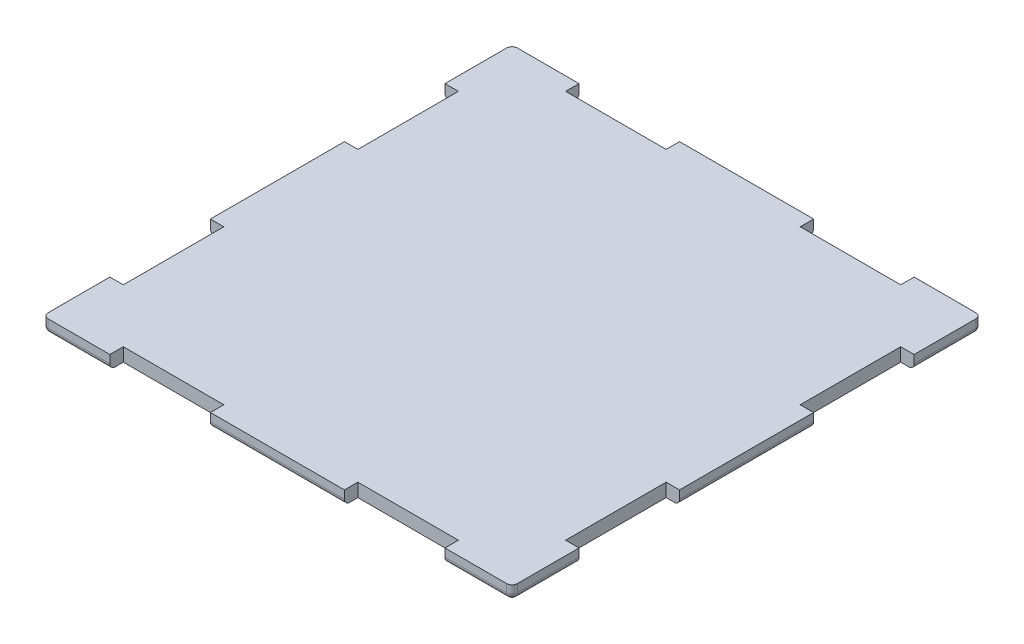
from build123d import *

# Parameters (mm, degrees)
SKETCH1_W           = 350
SKETCH1_H           = 350
BOSS_EXTRUDE1_DEPTH = 10
SKETCH2_W           = 10
SKETCH2_H           = 75
SKETCH2_W_2         = 75
SKETCH2_H_2         = 10
CUT_EXTRUDE2_DEPTH  = 10
FILLET1_R           = 4


with BuildPart() as part:
    # Sketch1 → Boss-Extrude1 (new body)
    with BuildSketch(Plane(origin=(0, 0, 0), x_dir=(1, 0, 0), z_dir=(0, 1, 0))):
        Rectangle(SKETCH1_W, SKETCH1_H)
    extrude(amount=BOSS_EXTRUDE1_DEPTH)

    # Sketch2 → Cut-Extrude2 (cut)
    with BuildSketch(Plane(origin=(0, 10, 0), x_dir=(1, 0, 0), z_dir=(0, 1, 0))):
        with Locations((-170, 87.5)):
            Rectangle(SKETCH2_W, SKETCH2_H)
        with Locations((-170, -87.5)):
            Rectangle(SKETCH2_W, SKETCH2_H)
        with Locations((87.5, 170)):
            Rectangle(SKETCH2_W_2, SKETCH2_H_2)
        with Locations((-87.5, 170)):
            Rectangle(SKETCH2_W_2, SKETCH2_H_2)
        with Locations((170, -87.5)):
            Rectangle(SKETCH2_W, SKETCH2_H)
        with Locations((170, 87.5)):
            Rectangle(SKETCH2_W, SKETCH2_H)
        with Locations((-87.5, -170)):
            Rectangle(SKETCH2_W_2, SKETCH2_H_2)
        with Locations((87.5, -170)):
            Rectangle(SKETCH2_W_2, SKETCH2_H_2)
    extrude(amount=-CUT_EXTRUDE2_DEPTH, mode=Mode.SUBTRACT)

    # Fillet1
    fillet1_edges = [part.edges().sort_by_distance(p)[0] for p in [
        (-175, 0, 0),
        (0, 0, -175),
        (-150, 0, -175),
        (175, 0, 0),
        (175, 0, -150),
        (0, 0, 175),
        (150, 0, 175),
        (-175, 0, 150),
        (150, 0, -175),
        (175, 0, 150),
        (-150, 0, 175),
        (-175, 0, -150),
        (-175, 5, -175),
        (175, 5, -175),
        (175, 5, 175),
        (-175, 5, 175),
    ]]
    fillet(fillet1_edges, radius=FILLET1_R)


solid = part.part
